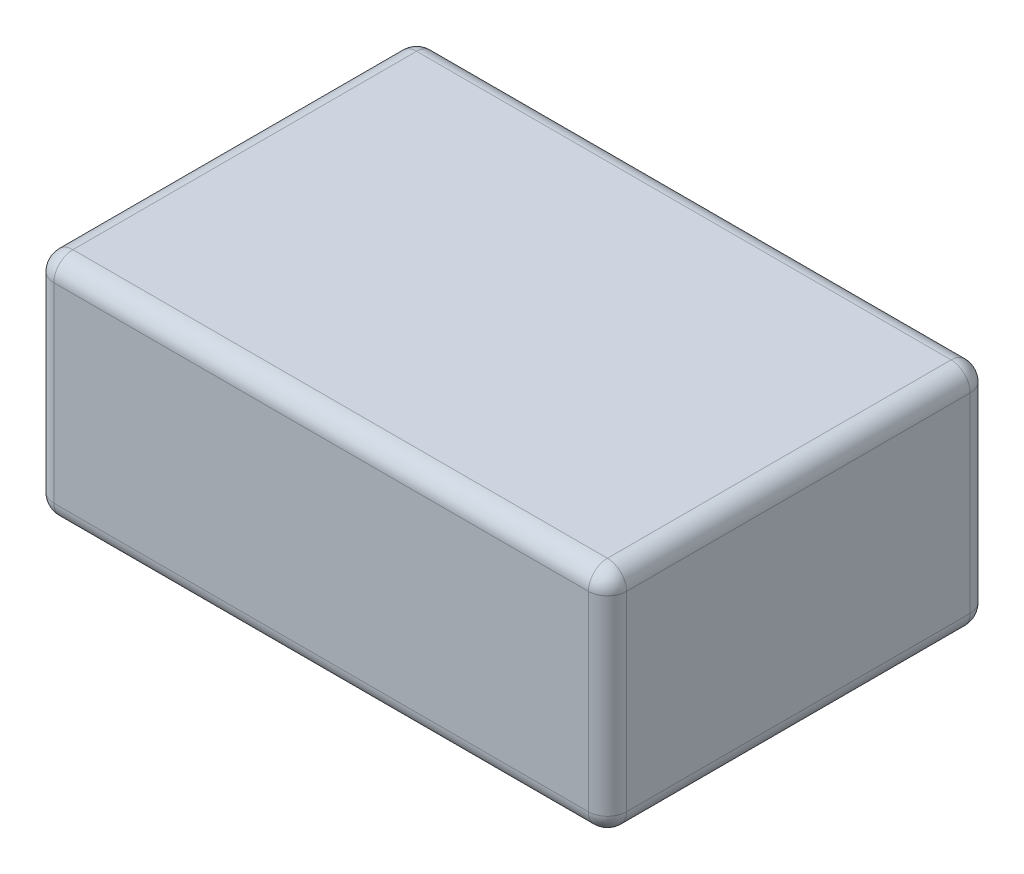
from build123d import *

# Parameters (mm, degrees)
SKETCH1_W           = 150
SKETCH1_H           = 100
BOSS_EXTRUDE1_DEPTH = 60
FILLET1_R           = 5
SKETCH4_R           = 3
CUT_EXTRUDE1_DEPTH  = 3
SKETCH5_R           = 3
SKETCH5_R_2         = 2
CUT_EXTRUDE2_DEPTH  = 10


with BuildPart() as part:
    # Sketch1 → Boss-Extrude1 (new body)
    with BuildSketch(Plane(origin=(0, 0, 0), x_dir=(1, 0, 0), z_dir=(0, 1, 0))):
        Rectangle(SKETCH1_W, SKETCH1_H)
    extrude(amount=BOSS_EXTRUDE1_DEPTH)

    # Fillet1
    fillet1_edges = [part.edges().sort_by_distance(p)[0] for p in [
        (-75, 60, 0),
        (0, 60, 50),
        (75, 60, 0),
        (0, 0, 50),
        (-75, 0, 0),
        (0, 0, -50),
        (75, 0, 0),
        (0, 60, -50),
        (75, 30, 50),
        (-75, 30, 50),
        (-75, 30, -50),
        (75, 30, -50),
    ]]
    fillet(fillet1_edges, radius=FILLET1_R)

    # Sketch4 → Cut-Extrude1 (cut)
    with BuildSketch(Plane.XZ):
        with Locations(Location((-25, 0, 0), (0, 0, 270))):
            Circle(SKETCH4_R)
        with Locations(Location((25, 0, 0), (0, 0, 270))):
            Circle(SKETCH4_R)
    extrude(amount=-CUT_EXTRUDE1_DEPTH, mode=Mode.SUBTRACT)

    # Sketch5 → Cut-Extrude2 (cut)
    with BuildSketch(Plane.ZY.offset(75)):
        with Locations((-37.5, 42.5)):
            Circle(SKETCH5_R)
        with Locations((-12.5, 42.5)):
            Circle(SKETCH5_R)
        with Locations((12.5, 42.5)):
            Circle(SKETCH5_R)
        with Locations((37.5, 42.5)):
            Circle(SKETCH5_R_2)
        with Locations((37.5, 17.5)):
            Circle(SKETCH5_R)
        with Locations((-12.5, 17.5)):
            Circle(SKETCH5_R)
        with Locations((-37.5, 17.5)):
            Circle(SKETCH5_R)
        with Locations((12.5, 17.5)):
            Circle(SKETCH5_R)
    extrude(amount=-CUT_EXTRUDE2_DEPTH, mode=Mode.SUBTRACT)


solid = part.part
